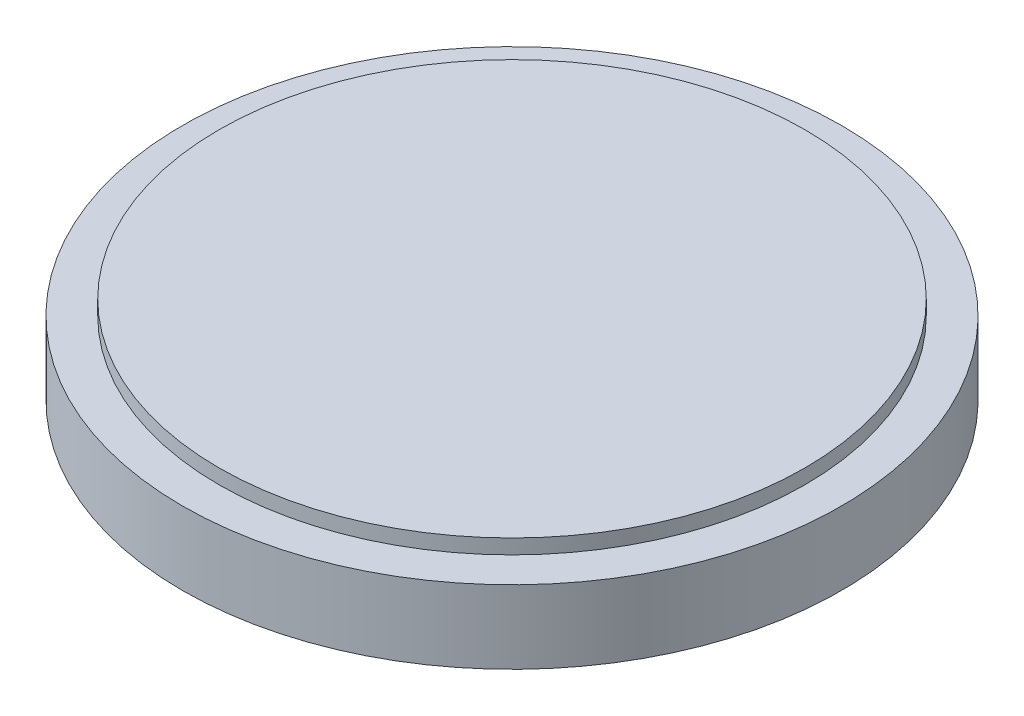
from build123d import *

# Parameters (mm, degrees)
SKETCH_1_R      = 45
EXTRUDE_1_DEPTH = 10
SKETCH_2_R      = 40
EXTRUDE_2_DEPTH = 2


with BuildPart() as part:
    # Sketch 1 → Extrude 1 (new body)
    with BuildSketch(Plane(origin=(0, 0, 0), x_dir=(1, 0, 0), z_dir=(0, 1, 0))):
        with Locations(Location((0, 0, 0), (0, 0, 270))):
            Circle(SKETCH_1_R)
    extrude(amount=EXTRUDE_1_DEPTH)

    # Sketch 2 → Extrude 2 (add)
    with BuildSketch(Plane(origin=(0, 10, 0), x_dir=(1, 0, 0), z_dir=(0, 1, 0))):
        with Locations(Location((0, 0, 0), (0, 0, 270))):
            Circle(SKETCH_2_R)
    extrude(amount=EXTRUDE_2_DEPTH)


solid = part.part
